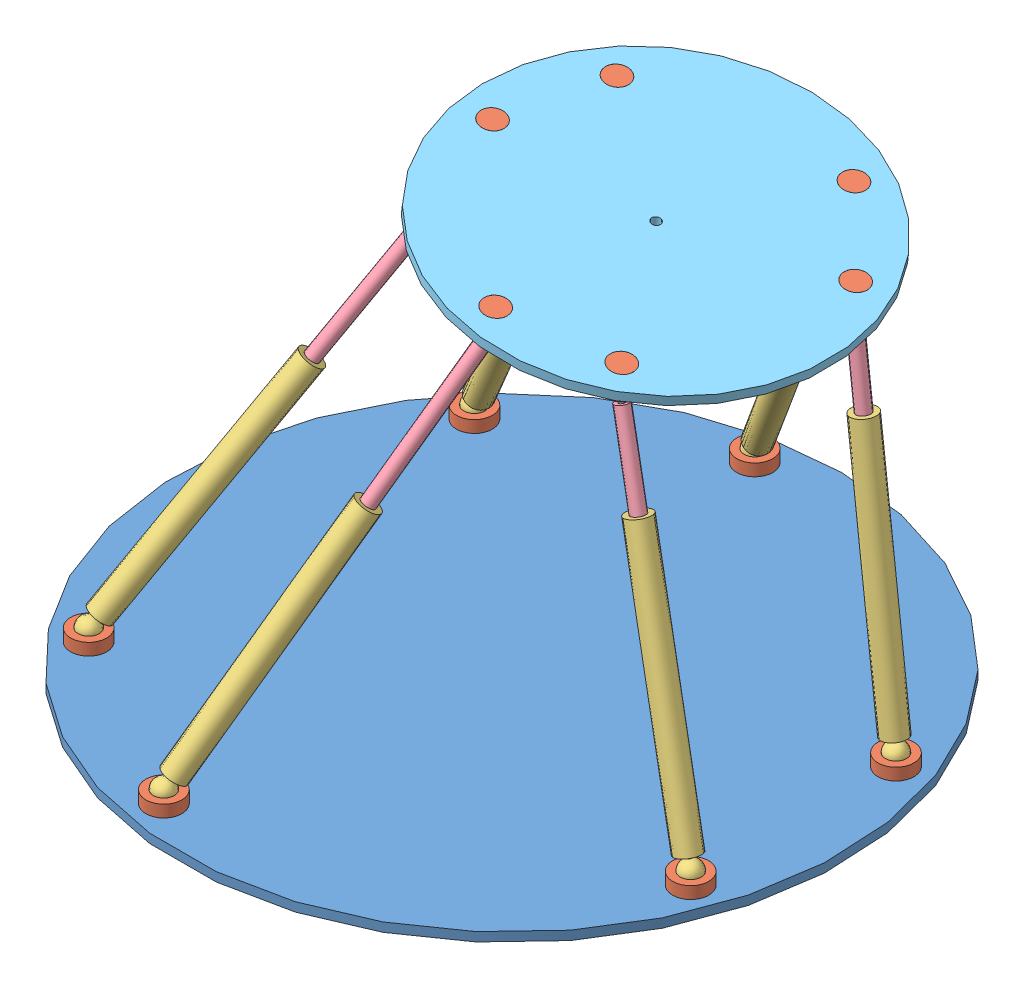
SolidWorks assembly StewartPmech.SLDASM, configuration ﾃﾞﾌｫﾙﾄ (file format 4400). Lengths in mm.
Overall size (2200 1503.56 2200).
27 component instances, 5 part files, 30 mates.
Components (placement in the parent):
- Base-1: Base.SLDPRT [ﾃﾞﾌｫﾙﾄ] at (-481.8496 98.1299 0) size (2200 30 2200)
- Pivot-1: Pivot.SLDPRT [ﾃﾞﾌｫﾙﾄ] at (-655.4977 98.1299 984.8078) x (0.93003 0 0.367483) z (-0.367483 0 0.93003) size (120 70 120)
- Pivot-2: Pivot.SLDPRT [ﾃﾞﾌｫﾙﾄ] at (457.8431 98.1299 -342.0201) size (120 70 120)
- Pivot-3: Pivot.SLDPRT [ﾃﾞﾌｫﾙﾄ] at (-1247.894 98.1299 -642.7876) size (120 70 120)
- Pivot-4: Pivot.SLDPRT [ﾃﾞﾌｫﾙﾄ] at (-1247.894 98.1299 642.7876) x (0.750906 0 0.660409) z (-0.660409 0 0.750906) size (120 70 120)
- Pivot-5: Pivot.SLDPRT [ﾃﾞﾌｫﾙﾄ] at (457.8431 98.1299 342.0201) x (0.953251 0 -0.302179) z (0.302179 0 0.953251) size (120 70 120)
- Pivot-6: Pivot.SLDPRT [ﾃﾞﾌｫﾙﾄ] at (-655.4977 98.1299 -984.8078) size (120 70 120)
- Lowerleg-1: Lowerleg.SLDPRT [ﾃﾞﾌｫﾙﾄ] at (-655.4977 168.2233 984.8078) x (-0.92377 0.132479 -0.359302) z (0.298333 0.837219 -0.458325) size (80 80 935)
- Lowerleg-2: Lowerleg.SLDPRT [ﾃﾞﾌｫﾙﾄ] at (457.8431 168.2233 342.0201) x (0.88127 0.304415 0.361518) z (-0.289627 0.952325 -0.095882) size (80 80 935)
- Lowerleg-3: Lowerleg.SLDPRT [ﾃﾞﾌｫﾙﾄ] at (-1247.894 168.2233 642.7876) x (0.92713 -0.370064 0.05902) z (0.35224 0.806834 -0.474284) size (80 80 935)
- Lowerleg-4: Lowerleg.SLDPRT [ﾃﾞﾌｫﾙﾄ] at (457.8431 168.2233 -342.0201) x (0.93031 0.17415 0.322792) z (-0.167649 0.984674 -0.048066) size (80 80 935)
- Lowerleg-5: Lowerleg.SLDPRT [ﾃﾞﾌｫﾙﾄ] at (-1247.894 168.2233 -642.7876) x (0.887795 -0.415262 -0.198437) z (0.443301 0.887448 0.126176) size (80 80 935)
- Lowerleg-6: Lowerleg.SLDPRT [ﾃﾞﾌｫﾙﾄ] at (-655.4977 168.2233 -984.8078) x (0.773912 -0.261307 -0.57687) z (0.468118 0.849542 0.243193) size (80 80 935)
- Upperleg-1: Upperleg.SLDPRT [ﾃﾞﾌｫﾙﾄ] at (16.3451 1387.4853 -635.7777) x (0.807717 -0.522985 0.272174) z (-0.468118 -0.849542 -0.243193) size (70 70 1080)
- Upperleg-2: Upperleg.SLDPRT [ﾃﾞﾌｫﾙﾄ] at (-677.6313 1474.4558 -125.0597) x (0.799729 -0.52272 -0.295292) z (-0.35224 -0.806834 0.474284) size (70 70 1080)
- Upperleg-3: Upperleg.SLDPRT [ﾃﾞﾌｫﾙﾄ] at (-222.5111 1383.323 319.6158) x (-0.590647 0.539143 0.600384) z (-0.298333 -0.837219 0.458325) size (70 70 1080)
- Upperleg-4: Upperleg.SLDPRT [ﾃﾞﾌｫﾙﾄ] at (258.5096 1338.9945 -399.1708) x (0.916598 0.137737 -0.375335) z (0.167649 -0.984674 0.048066) size (70 70 1080)
- Upperleg-5: Upperleg.SLDPRT [ﾃﾞﾌｫﾙﾄ] at (102.6072 1336.2778 224.418) x (-0.295975 0.006155 0.955176) z (0.289627 -0.952325 0.095882) size (70 70 1080)
- Upperleg-6: Upperleg.SLDPRT [ﾃﾞﾌｫﾙﾄ] at (-594.6774 1475.9014 -456.8644) x (-0.544969 0.155072 0.823991) z (-0.443301 -0.887448 -0.126176) size (70 70 1080)
- Movingplate-2: Movingplate.SLDASM [ﾃﾞﾌｫﾙﾄ] at (59.4979 1307.0673 706.0202) x (0.268757 -0.084295 0.959512) z (-0.950582 0.137551 0.27834) size (1200 70 1200)
  - Movingplate-1: Movingplate.SLDPRT [ﾃﾞﾌｫﾙﾄ] at (-922.826 54.8355 0) size (1200 30 1200)
  - Pivot-1: Pivot.SLDPRT [ﾃﾞﾌｫﾙﾄ] at (-1009.6501 84.8355 -492.4039) x (-0.787002 0 -0.61695) z (-0.61695 0 0.787002) size (120 70 120)
  - Pivot-2: Pivot.SLDPRT [ﾃﾞﾌｫﾙﾄ] at (-1305.8482 84.8355 321.3938) x (-0.897605 0 -0.440802) z (-0.440802 0 0.897605) size (120 70 120)
  - Pivot-3: Pivot.SLDPRT [ﾃﾞﾌｫﾙﾄ] at (-1305.8482 84.8355 -321.3938) x (-0.837169 0 -0.546944) z (-0.546944 0 0.837169) size (120 70 120)
  - Pivot-4: Pivot.SLDPRT [ﾃﾞﾌｫﾙﾄ] at (-452.9797 84.8355 -171.0101) x (-0.976971 0 -0.213371) z (-0.213371 0 0.976971) size (120 70 120)
  - Pivot-5: Pivot.SLDPRT [ﾃﾞﾌｫﾙﾄ] at (-452.9797 84.8355 171.0101) x (-0.976823 0 -0.214048) z (-0.214048 0 0.976823) size (120 70 120)
  - Pivot-6: Pivot.SLDPRT [ﾃﾞﾌｫﾙﾄ] at (-1009.6501 84.8355 492.4039) x (-0.42221 0 -0.906498) z (-0.906498 0 0.42221) size (120 70 120)
Mates (geometry in assembly coordinates):
- 同心円2: concentric anti-aligned: cylinder of Base-1 through (-1247.894 98.1299 642.7876) axis (0 1 0) radius 40; cylinder of Pivot-4 through (-1247.894 73.0019 642.7876) axis (0 -1 0) radius 40
- 同心円3: concentric anti-aligned: cylinder of Base-1 through (-655.4977 98.1299 984.8078) axis (0 1 0) radius 40; cylinder of Pivot-1 through (-655.4977 73.0019 984.8078) axis (0 -1 0) radius 40
- 同心円4: concentric anti-aligned: cylinder of Base-1 through (457.8431 98.1299 342.0201) axis (0 1 0) radius 40; cylinder of Pivot-5 through (457.8431 73.0019 342.0201) axis (0 -1 0) radius 40
- 同心円8: concentric anti-aligned: cylinder of Base-1 through (-655.4977 98.1299 -984.8078) axis (0 1 0) radius 40; cylinder of Pivot-6 through (-655.4977 73.0019 -984.8078) axis (0 -1 0) radius 40
- 同心円9: concentric anti-aligned: cylinder of Base-1 through (-1247.894 98.1299 -642.7876) axis (0 1 0) radius 40; cylinder of Pivot-3 through (-1247.894 73.0019 -642.7876) axis (0 -1 0) radius 40
- 同心円10: concentric anti-aligned: cylinder of Base-1 through (457.8431 98.1299 -342.0201) axis (0 1 0) radius 40; cylinder of Pivot-2 through (457.8431 73.0019 -342.0201) axis (0 -1 0) radius 40
- 一致1: coincident anti-aligned: plane of Base-1 through (-481.8496 128.1299 0) normal (0 1 0); circle of Pivot-4
- 一致2: coincident anti-aligned: plane of Base-1 through (-481.8496 128.1299 0) normal (0 1 0); plane of Pivot-6 through (-615.4977 128.1299 -984.8078) normal (0 -1 0)
- 一致3: coincident anti-aligned: plane of Base-1 through (-481.8496 128.1299 0) normal (0 1 0); plane of Pivot-1 through (-618.2965 128.1299 999.5071) normal (0 -1 0)
- 一致4: coincident anti-aligned: plane of Base-1 through (-481.8496 128.1299 0) normal (0 1 0); plane of Pivot-2 through (497.8431 128.1299 -342.0201) normal (0 -1 0)
- 一致5: coincident anti-aligned: plane of Base-1 through (-481.8496 128.1299 0) normal (0 1 0); plane of Pivot-5 through (495.9731 128.1299 329.933) normal (0 -1 0)
- 一致6: coincident anti-aligned: plane of Base-1 through (-481.8496 128.1299 0) normal (0 1 0); plane of Pivot-3 through (-1207.894 128.1299 -642.7876) normal (0 -1 0)
- 同心円12: concentric: sphere of Pivot-1; sphere of Lowerleg-1
- 同心円13: concentric: sphere of Pivot-4; sphere of Lowerleg-3
- 同心円14: concentric: sphere of Pivot-5; sphere of Lowerleg-2
- 同心円15: concentric: sphere of Pivot-2; sphere of Lowerleg-4
- 同心円16: concentric: sphere of Pivot-6; sphere of Lowerleg-6
- 同心円17: concentric: sphere of Pivot-3; sphere of Lowerleg-5
- 同心円18: concentric aligned: cylinder of Upperleg-6 through (-1057.9274 548.5185 -588.7179) axis (0.443301 0.887448 0.126176) radius 22.5; cylinder of Lowerleg-5 through (-1048.4083 567.5748 -586.0086) axis (0.443301 0.887448 0.126176) radius 22.5
- 同心円19: concentric aligned: cylinder of Upperleg-1 through (-472.8386 499.7135 -889.9143) axis (0.468118 0.849542 0.243193) radius 22.5; cylinder of Lowerleg-6 through (-444.8444 550.5174 -875.371) axis (0.468118 0.849542 0.243193) radius 22.5
- 同心円20: concentric aligned: cylinder of Upperleg-4 through (433.7027 310.0099 -348.9414) axis (-0.167649 0.984674 -0.048066) radius 22.5; cylinder of Lowerleg-4 through (382.401 611.3267 -363.65) axis (-0.167649 0.984674 -0.048066) radius 22.5
- 同心円21: concentric aligned: cylinder of Upperleg-5 through (405.2673 341.0981 324.6147) axis (-0.289627 0.952325 -0.095882) radius 22.5; cylinder of Lowerleg-2 through (327.511 596.7695 298.8732) axis (-0.289627 0.952325 -0.095882) radius 22.5
- 同心円22: concentric aligned: cylinder of Lowerleg-3 through (-1089.386 531.2987 429.3597) axis (0.35224 0.806834 -0.474284) radius 22.5; cylinder of Upperleg-2 through (-1045.7222 631.3141 370.5673) axis (0.35224 0.806834 -0.474284) radius 22.5
- 同心円23: concentric aligned: cylinder of Lowerleg-1 through (-521.2478 544.9717 778.5613) axis (0.298333 0.837219 -0.458325) radius 22.5; cylinder of Upperleg-3 through (-534.2692 508.4295 798.5659) axis (0.298333 0.837219 -0.458325) radius 22.5
- 同心円31: concentric: sphere of Upperleg-5; sphere of Movingplate-2/Pivot-4
- 同心円32: concentric: sphere of Upperleg-3; sphere of Movingplate-2/Pivot-5
- 同心円33: concentric: sphere of Upperleg-1; sphere of Movingplate-2/Pivot-3
- 同心円34: concentric: sphere of Upperleg-4; sphere of Movingplate-2/Pivot-1
- 同心円35: concentric: sphere of Upperleg-6; sphere of Movingplate-2/Pivot-2
- 同心円36: concentric: sphere of Upperleg-2; sphere of Movingplate-2/Pivot-6
